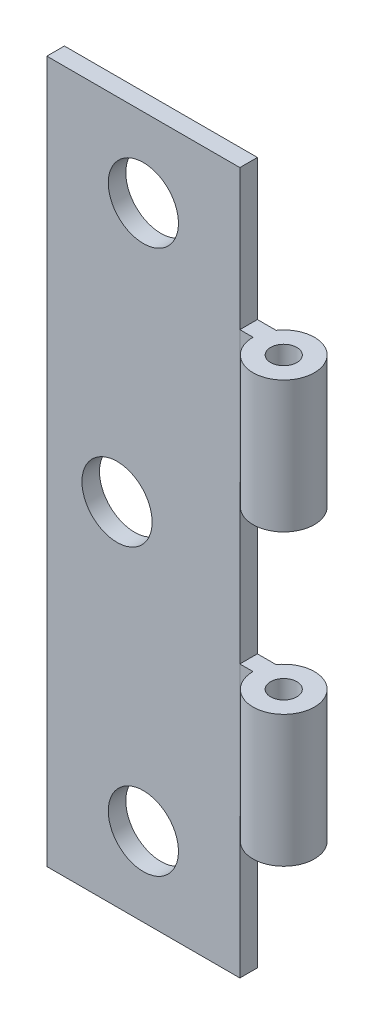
ISO-10303-21;
HEADER;
FILE_DESCRIPTION(('STEP AP214'),'2;1');
FILE_NAME('part.step','',(''),(''),'','','');
FILE_SCHEMA(('AUTOMOTIVE_DESIGN { 1 0 10303 214 1 1 1 1 }'));
ENDSEC;
DATA;
#1=APPLICATION_CONTEXT('core data for automotive mechanical design processes');
#2=APPLICATION_PROTOCOL_DEFINITION('international standard','automotive_design',2000,#1);
#3=PRODUCT_CONTEXT('',#1,'mechanical');
#4=PRODUCT('Part','Part','',(#3));
#5=PRODUCT_RELATED_PRODUCT_CATEGORY('part','',(#4));
#6=PRODUCT_DEFINITION_FORMATION('','',#4);
#7=PRODUCT_DEFINITION_CONTEXT('part definition',#1,'design');
#8=PRODUCT_DEFINITION('design','',#6,#7);
#9=PRODUCT_DEFINITION_SHAPE('','',#8);
#10=(LENGTH_UNIT() NAMED_UNIT(*) SI_UNIT(.MILLI.,.METRE.));
#11=(NAMED_UNIT(*) PLANE_ANGLE_UNIT() SI_UNIT($,.RADIAN.));
#12=(NAMED_UNIT(*) SI_UNIT($,.STERADIAN.) SOLID_ANGLE_UNIT());
#13=UNCERTAINTY_MEASURE_WITH_UNIT(LENGTH_MEASURE(1.E-05),#10,'distance_accuracy_value','');
#14=(GEOMETRIC_REPRESENTATION_CONTEXT(3) GLOBAL_UNCERTAINTY_ASSIGNED_CONTEXT((#13)) GLOBAL_UNIT_ASSIGNED_CONTEXT((#10,
#11,#12)) REPRESENTATION_CONTEXT('',''));
#15=CARTESIAN_POINT('',(0.,0.,0.));
#16=DIRECTION('',(0.,0.,1.));
#17=DIRECTION('',(1.,0.,0.));
#18=AXIS2_PLACEMENT_3D('',#15,#16,#17);
#19=CARTESIAN_POINT('',(12.7,-39.6077241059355,0.));
#20=DIRECTION('',(0.,1.,0.));
#21=DIRECTION('',(0.,0.,1.));
#22=AXIS2_PLACEMENT_3D('',#19,#20,#21);
#23=CYLINDRICAL_SURFACE('',#22,1.190625);
#24=CARTESIAN_POINT('',(12.7,-19.05,0.));
#25=DIRECTION('',(0.,1.,0.));
#26=DIRECTION('',(0.,0.,1.));
#27=AXIS2_PLACEMENT_3D('',#24,#25,#26);
#28=CIRCLE('',#27,1.190625);
#29=CARTESIAN_POINT('',(12.7,-19.05,1.190625));
#30=VERTEX_POINT('',#29);
#31=EDGE_CURVE('E140',#30,#30,#28,.F.);
#32=ORIENTED_EDGE('',*,*,#31,.T.);
#33=EDGE_LOOP('',(#32));
#34=FACE_BOUND('',#33,.T.);
#35=CARTESIAN_POINT('',(12.7,-7.14375,0.));
#36=DIRECTION('',(0.,1.,0.));
#37=DIRECTION('',(0.,0.,1.));
#38=AXIS2_PLACEMENT_3D('',#35,#36,#37);
#39=CIRCLE('',#38,1.190625);
#40=CARTESIAN_POINT('',(12.7,-7.14375,1.190625));
#41=VERTEX_POINT('',#40);
#42=EDGE_CURVE('E13',#41,#41,#39,.F.);
#43=ORIENTED_EDGE('',*,*,#42,.F.);
#44=EDGE_LOOP('',(#43));
#45=FACE_BOUND('',#44,.T.);
#46=ADVANCED_FACE('F67',(#34,#45),#23,.F.);
#47=CARTESIAN_POINT('',(12.7,-39.6077241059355,0.));
#48=DIRECTION('',(0.,1.,0.));
#49=DIRECTION('',(0.,0.,1.));
#50=AXIS2_PLACEMENT_3D('',#47,#48,#49);
#51=CYLINDRICAL_SURFACE('',#50,2.778125);
#52=CARTESIAN_POINT('',(12.7,-7.14375,0.));
#53=DIRECTION('',(0.,1.,0.));
#54=DIRECTION('',(0.,0.,1.));
#55=AXIS2_PLACEMENT_3D('',#52,#53,#54);
#56=CIRCLE('',#55,2.778125);
#57=CARTESIAN_POINT('',(10.4201266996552,-7.14375,-1.5875));
#58=VERTEX_POINT('',#57);
#59=CARTESIAN_POINT('',(9.92187500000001,-7.14375,0.));
#60=VERTEX_POINT('',#59);
#61=EDGE_CURVE('E84',#58,#60,#56,.F.);
#62=ORIENTED_EDGE('',*,*,#61,.T.);
#63=DIRECTION('',(0.,1.,0.));
#64=VECTOR('',#63,1.);
#65=CARTESIAN_POINT('',(9.92187500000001,-39.6077241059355,0.));
#66=LINE('',#65,#64);
#67=CARTESIAN_POINT('',(9.92187500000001,-19.05,0.));
#68=VERTEX_POINT('',#67);
#69=EDGE_CURVE('E136',#68,#60,#66,.T.);
#70=ORIENTED_EDGE('',*,*,#69,.F.);
#71=CARTESIAN_POINT('',(12.7,-19.05,0.));
#72=DIRECTION('',(0.,1.,0.));
#73=DIRECTION('',(0.,0.,1.));
#74=AXIS2_PLACEMENT_3D('',#71,#72,#73);
#75=CIRCLE('',#74,2.778125);
#76=CARTESIAN_POINT('',(10.4201266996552,-19.05,-1.5875));
#77=VERTEX_POINT('',#76);
#78=EDGE_CURVE('E103',#77,#68,#75,.F.);
#79=ORIENTED_EDGE('',*,*,#78,.F.);
#80=DIRECTION('',(0.,1.,0.));
#81=VECTOR('',#80,1.);
#82=CARTESIAN_POINT('',(10.4201266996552,-39.6077241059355,-1.5875));
#83=LINE('',#82,#81);
#84=EDGE_CURVE('E134',#77,#58,#83,.T.);
#85=ORIENTED_EDGE('',*,*,#84,.T.);
#86=EDGE_LOOP('',(#62,#70,#79,#85));
#87=FACE_BOUND('',#86,.T.);
#88=ADVANCED_FACE('F159',(#87),#51,.T.);
#89=CARTESIAN_POINT('',(8.73125000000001,-39.6077241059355,0.));
#90=DIRECTION('',(0.,0.,1.));
#91=DIRECTION('',(1.,0.,0.));
#92=AXIS2_PLACEMENT_3D('',#89,#90,#91);
#93=PLANE('',#92);
#94=ORIENTED_EDGE('',*,*,#69,.T.);
#95=DIRECTION('',(-1.,0.,0.));
#96=VECTOR('',#95,1.);
#97=CARTESIAN_POINT('',(8.73125000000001,-7.14375,0.));
#98=LINE('',#97,#96);
#99=CARTESIAN_POINT('',(8.73125000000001,-7.14375,0.));
#100=VERTEX_POINT('',#99);
#101=EDGE_CURVE('E130',#60,#100,#98,.T.);
#102=ORIENTED_EDGE('',*,*,#101,.T.);
#103=DIRECTION('',(0.,1.,0.));
#104=VECTOR('',#103,1.);
#105=CARTESIAN_POINT('',(8.73125000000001,-39.6077241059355,0.));
#106=LINE('',#105,#104);
#107=CARTESIAN_POINT('',(8.73125000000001,-19.05,0.));
#108=VERTEX_POINT('',#107);
#109=EDGE_CURVE('E125',#108,#100,#106,.T.);
#110=ORIENTED_EDGE('',*,*,#109,.F.);
#111=DIRECTION('',(-1.,0.,0.));
#112=VECTOR('',#111,1.);
#113=CARTESIAN_POINT('',(8.73125000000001,-19.05,0.));
#114=LINE('',#113,#112);
#115=EDGE_CURVE('E109',#68,#108,#114,.T.);
#116=ORIENTED_EDGE('',*,*,#115,.F.);
#117=EDGE_LOOP('',(#94,#102,#110,#116));
#118=FACE_BOUND('',#117,.T.);
#119=ADVANCED_FACE('F129',(#118),#93,.T.);
#120=CARTESIAN_POINT('',(8.73125000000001,-39.6077241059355,-1.5875));
#121=DIRECTION('',(0.,0.,1.));
#122=DIRECTION('',(1.,0.,0.));
#123=AXIS2_PLACEMENT_3D('',#120,#121,#122);
#124=PLANE('',#123);
#125=DIRECTION('',(-1.,0.,0.));
#126=VECTOR('',#125,1.);
#127=CARTESIAN_POINT('',(8.73125000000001,-7.14375,-1.5875));
#128=LINE('',#127,#126);
#129=CARTESIAN_POINT('',(8.73125000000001,-7.14375,-1.5875));
#130=VERTEX_POINT('',#129);
#131=EDGE_CURVE('E76',#58,#130,#128,.T.);
#132=ORIENTED_EDGE('',*,*,#131,.F.);
#133=ORIENTED_EDGE('',*,*,#84,.F.);
#134=DIRECTION('',(-1.,0.,0.));
#135=VECTOR('',#134,1.);
#136=CARTESIAN_POINT('',(8.73125000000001,-19.05,-1.5875));
#137=LINE('',#136,#135);
#138=CARTESIAN_POINT('',(8.73125000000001,-19.05,-1.5875));
#139=VERTEX_POINT('',#138);
#140=EDGE_CURVE('E132',#77,#139,#137,.T.);
#141=ORIENTED_EDGE('',*,*,#140,.T.);
#142=DIRECTION('',(0.,1.,0.));
#143=VECTOR('',#142,1.);
#144=CARTESIAN_POINT('',(8.73125000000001,-39.6077241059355,-1.5875));
#145=LINE('',#144,#143);
#146=EDGE_CURVE('E70',#139,#130,#145,.T.);
#147=ORIENTED_EDGE('',*,*,#146,.T.);
#148=EDGE_LOOP('',(#132,#133,#141,#147));
#149=FACE_BOUND('',#148,.T.);
#150=ADVANCED_FACE('F156',(#149),#124,.F.);
#151=CARTESIAN_POINT('',(8.73125000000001,-39.6077241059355,-1.5875));
#152=DIRECTION('',(-1.,0.,0.));
#153=DIRECTION('',(0.,0.,1.));
#154=AXIS2_PLACEMENT_3D('',#151,#152,#153);
#155=PLANE('',#154);
#156=ORIENTED_EDGE('',*,*,#109,.T.);
#157=DIRECTION('',(0.,0.,-1.));
#158=VECTOR('',#157,1.);
#159=CARTESIAN_POINT('',(8.73125000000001,-7.14375,-1.5875));
#160=LINE('',#159,#158);
#161=EDGE_CURVE('E118',#100,#130,#160,.T.);
#162=ORIENTED_EDGE('',*,*,#161,.T.);
#163=ORIENTED_EDGE('',*,*,#146,.F.);
#164=DIRECTION('',(0.,0.,-1.));
#165=VECTOR('',#164,1.);
#166=CARTESIAN_POINT('',(8.73125000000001,-19.05,-1.5875));
#167=LINE('',#166,#165);
#168=EDGE_CURVE('E113',#108,#139,#167,.T.);
#169=ORIENTED_EDGE('',*,*,#168,.F.);
#170=EDGE_LOOP('',(#156,#162,#163,#169));
#171=FACE_BOUND('',#170,.T.);
#172=ADVANCED_FACE('F123',(#171),#155,.T.);
#173=CARTESIAN_POINT('',(0.,-19.05,2.778125));
#174=DIRECTION('',(0.,1.,0.));
#175=DIRECTION('',(0.,0.,1.));
#176=AXIS2_PLACEMENT_3D('',#173,#174,#175);
#177=PLANE('',#176);
#178=ORIENTED_EDGE('',*,*,#115,.T.);
#179=ORIENTED_EDGE('',*,*,#168,.T.);
#180=ORIENTED_EDGE('',*,*,#140,.F.);
#181=ORIENTED_EDGE('',*,*,#78,.T.);
#182=EDGE_LOOP('',(#178,#179,#180,#181));
#183=FACE_BOUND('',#182,.T.);
#184=ORIENTED_EDGE('',*,*,#31,.F.);
#185=EDGE_LOOP('',(#184));
#186=FACE_BOUND('',#185,.T.);
#187=ADVANCED_FACE('F111',(#183,#186),#177,.F.);
#188=CARTESIAN_POINT('',(0.,-7.14375,2.778125));
#189=DIRECTION('',(0.,1.,0.));
#190=DIRECTION('',(0.,0.,1.));
#191=AXIS2_PLACEMENT_3D('',#188,#189,#190);
#192=PLANE('',#191);
#193=ORIENTED_EDGE('',*,*,#101,.F.);
#194=ORIENTED_EDGE('',*,*,#61,.F.);
#195=ORIENTED_EDGE('',*,*,#131,.T.);
#196=ORIENTED_EDGE('',*,*,#161,.F.);
#197=EDGE_LOOP('',(#193,#194,#195,#196));
#198=FACE_BOUND('',#197,.T.);
#199=ORIENTED_EDGE('',*,*,#42,.T.);
#200=EDGE_LOOP('',(#199));
#201=FACE_BOUND('',#200,.T.);
#202=ADVANCED_FACE('F149',(#198,#201),#192,.T.);
#203=CLOSED_SHELL('',(#46,#88,#119,#150,#172,#187,#202));
#204=MANIFOLD_SOLID_BREP('B2',#203);
#205=CARTESIAN_POINT('',(8.73125000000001,-39.6077241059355,-1.5875));
#206=DIRECTION('',(-1.,0.,0.));
#207=DIRECTION('',(0.,0.,1.));
#208=AXIS2_PLACEMENT_3D('',#205,#206,#207);
#209=PLANE('',#208);
#210=DIRECTION('',(0.,0.,-1.));
#211=VECTOR('',#210,1.);
#212=CARTESIAN_POINT('',(8.73125000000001,7.14375,-1.5875));
#213=LINE('',#212,#211);
#214=CARTESIAN_POINT('',(8.73125000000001,7.14375,0.));
#215=VERTEX_POINT('',#214);
#216=CARTESIAN_POINT('',(8.73125000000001,7.14375,-1.5875));
#217=VERTEX_POINT('',#216);
#218=EDGE_CURVE('E65',#215,#217,#213,.T.);
#219=ORIENTED_EDGE('',*,*,#218,.F.);
#220=DIRECTION('',(0.,1.,0.));
#221=VECTOR('',#220,1.);
#222=CARTESIAN_POINT('',(8.73125000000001,-39.6077241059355,0.));
#223=LINE('',#222,#221);
#224=CARTESIAN_POINT('',(8.73125000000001,19.05,0.));
#225=VERTEX_POINT('',#224);
#226=EDGE_CURVE('E271',#215,#225,#223,.T.);
#227=ORIENTED_EDGE('',*,*,#226,.T.);
#228=DIRECTION('',(0.,0.,-1.));
#229=VECTOR('',#228,1.);
#230=CARTESIAN_POINT('',(8.73125000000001,19.05,-1.5875));
#231=LINE('',#230,#229);
#232=CARTESIAN_POINT('',(8.73125000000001,19.05,-1.5875));
#233=VERTEX_POINT('',#232);
#234=EDGE_CURVE('E229',#225,#233,#231,.T.);
#235=ORIENTED_EDGE('',*,*,#234,.T.);
#236=DIRECTION('',(0.,1.,0.));
#237=VECTOR('',#236,1.);
#238=CARTESIAN_POINT('',(8.73125000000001,-39.6077241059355,-1.5875));
#239=LINE('',#238,#237);
#240=EDGE_CURVE('E277',#217,#233,#239,.T.);
#241=ORIENTED_EDGE('',*,*,#240,.F.);
#242=EDGE_LOOP('',(#219,#227,#235,#241));
#243=FACE_BOUND('',#242,.T.);
#244=ADVANCED_FACE('F221',(#243),#209,.T.);
#245=CARTESIAN_POINT('',(8.73125000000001,-39.6077241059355,-1.5875));
#246=DIRECTION('',(0.,0.,1.));
#247=DIRECTION('',(1.,0.,0.));
#248=AXIS2_PLACEMENT_3D('',#245,#246,#247);
#249=PLANE('',#248);
#250=DIRECTION('',(0.,1.,0.));
#251=VECTOR('',#250,1.);
#252=CARTESIAN_POINT('',(10.4201266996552,-39.6077241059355,-1.5875));
#253=LINE('',#252,#251);
#254=CARTESIAN_POINT('',(10.4201266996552,7.14375,-1.5875));
#255=VERTEX_POINT('',#254);
#256=CARTESIAN_POINT('',(10.4201266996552,19.05,-1.5875));
#257=VERTEX_POINT('',#256);
#258=EDGE_CURVE('E276',#255,#257,#253,.T.);
#259=ORIENTED_EDGE('',*,*,#258,.F.);
#260=DIRECTION('',(-1.,0.,0.));
#261=VECTOR('',#260,1.);
#262=CARTESIAN_POINT('',(8.73125000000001,7.14375,-1.5875));
#263=LINE('',#262,#261);
#264=EDGE_CURVE('E290',#255,#217,#263,.T.);
#265=ORIENTED_EDGE('',*,*,#264,.T.);
#266=ORIENTED_EDGE('',*,*,#240,.T.);
#267=DIRECTION('',(-1.,0.,0.));
#268=VECTOR('',#267,1.);
#269=CARTESIAN_POINT('',(8.73125000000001,19.05,-1.5875));
#270=LINE('',#269,#268);
#271=EDGE_CURVE('E236',#257,#233,#270,.T.);
#272=ORIENTED_EDGE('',*,*,#271,.F.);
#273=EDGE_LOOP('',(#259,#265,#266,#272));
#274=FACE_BOUND('',#273,.T.);
#275=ADVANCED_FACE('F300',(#274),#249,.F.);
#276=CARTESIAN_POINT('',(8.73125000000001,-39.6077241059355,0.));
#277=DIRECTION('',(0.,0.,1.));
#278=DIRECTION('',(1.,0.,0.));
#279=AXIS2_PLACEMENT_3D('',#276,#277,#278);
#280=PLANE('',#279);
#281=DIRECTION('',(-1.,0.,0.));
#282=VECTOR('',#281,1.);
#283=CARTESIAN_POINT('',(8.73125000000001,7.14375,0.));
#284=LINE('',#283,#282);
#285=CARTESIAN_POINT('',(9.92187500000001,7.14375,0.));
#286=VERTEX_POINT('',#285);
#287=EDGE_CURVE('E243',#286,#215,#284,.T.);
#288=ORIENTED_EDGE('',*,*,#287,.F.);
#289=DIRECTION('',(0.,1.,0.));
#290=VECTOR('',#289,1.);
#291=CARTESIAN_POINT('',(9.92187500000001,-39.6077241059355,0.));
#292=LINE('',#291,#290);
#293=CARTESIAN_POINT('',(9.92187500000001,19.05,0.));
#294=VERTEX_POINT('',#293);
#295=EDGE_CURVE('E267',#286,#294,#292,.T.);
#296=ORIENTED_EDGE('',*,*,#295,.T.);
#297=DIRECTION('',(-1.,0.,0.));
#298=VECTOR('',#297,1.);
#299=CARTESIAN_POINT('',(8.73125000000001,19.05,0.));
#300=LINE('',#299,#298);
#301=EDGE_CURVE('E261',#294,#225,#300,.T.);
#302=ORIENTED_EDGE('',*,*,#301,.T.);
#303=ORIENTED_EDGE('',*,*,#226,.F.);
#304=EDGE_LOOP('',(#288,#296,#302,#303));
#305=FACE_BOUND('',#304,.T.);
#306=ADVANCED_FACE('F223',(#305),#280,.T.);
#307=CARTESIAN_POINT('',(12.7,-39.6077241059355,0.));
#308=DIRECTION('',(0.,1.,0.));
#309=DIRECTION('',(0.,0.,1.));
#310=AXIS2_PLACEMENT_3D('',#307,#308,#309);
#311=CYLINDRICAL_SURFACE('',#310,2.778125);
#312=CARTESIAN_POINT('',(12.7,7.14375,0.));
#313=DIRECTION('',(0.,1.,0.));
#314=DIRECTION('',(-1.,0.,0.));
#315=AXIS2_PLACEMENT_3D('',#312,#313,#314);
#316=CIRCLE('',#315,2.778125);
#317=EDGE_CURVE('E288',#255,#286,#316,.F.);
#318=ORIENTED_EDGE('',*,*,#317,.F.);
#319=ORIENTED_EDGE('',*,*,#258,.T.);
#320=CARTESIAN_POINT('',(12.7,19.05,0.));
#321=DIRECTION('',(0.,1.,0.));
#322=DIRECTION('',(0.,0.,1.));
#323=AXIS2_PLACEMENT_3D('',#320,#321,#322);
#324=CIRCLE('',#323,2.778125);
#325=EDGE_CURVE('E274',#257,#294,#324,.F.);
#326=ORIENTED_EDGE('',*,*,#325,.T.);
#327=ORIENTED_EDGE('',*,*,#295,.F.);
#328=EDGE_LOOP('',(#318,#319,#326,#327));
#329=FACE_BOUND('',#328,.T.);
#330=ADVANCED_FACE('F297',(#329),#311,.T.);
#331=CARTESIAN_POINT('',(0.,19.05,2.778125));
#332=DIRECTION('',(0.,1.,0.));
#333=DIRECTION('',(0.,0.,1.));
#334=AXIS2_PLACEMENT_3D('',#331,#332,#333);
#335=PLANE('',#334);
#336=ORIENTED_EDGE('',*,*,#325,.F.);
#337=ORIENTED_EDGE('',*,*,#271,.T.);
#338=ORIENTED_EDGE('',*,*,#234,.F.);
#339=ORIENTED_EDGE('',*,*,#301,.F.);
#340=EDGE_LOOP('',(#336,#337,#338,#339));
#341=FACE_BOUND('',#340,.T.);
#342=CARTESIAN_POINT('',(12.7,19.05,0.));
#343=DIRECTION('',(0.,1.,0.));
#344=DIRECTION('',(0.,0.,1.));
#345=AXIS2_PLACEMENT_3D('',#342,#343,#344);
#346=CIRCLE('',#345,1.190625);
#347=CARTESIAN_POINT('',(12.7,19.05,1.190625));
#348=VERTEX_POINT('',#347);
#349=EDGE_CURVE('E273',#348,#348,#346,.F.);
#350=ORIENTED_EDGE('',*,*,#349,.T.);
#351=EDGE_LOOP('',(#350));
#352=FACE_BOUND('',#351,.T.);
#353=ADVANCED_FACE('F259',(#341,#352),#335,.T.);
#354=CARTESIAN_POINT('',(0.,7.14375,2.778125));
#355=DIRECTION('',(0.,1.,0.));
#356=DIRECTION('',(-1.,0.,0.));
#357=AXIS2_PLACEMENT_3D('',#354,#355,#356);
#358=PLANE('',#357);
#359=ORIENTED_EDGE('',*,*,#287,.T.);
#360=ORIENTED_EDGE('',*,*,#218,.T.);
#361=ORIENTED_EDGE('',*,*,#264,.F.);
#362=ORIENTED_EDGE('',*,*,#317,.T.);
#363=EDGE_LOOP('',(#359,#360,#361,#362));
#364=FACE_BOUND('',#363,.T.);
#365=CARTESIAN_POINT('',(12.7,7.14375,0.));
#366=DIRECTION('',(0.,1.,0.));
#367=DIRECTION('',(-1.,0.,0.));
#368=AXIS2_PLACEMENT_3D('',#365,#366,#367);
#369=CIRCLE('',#368,1.190625);
#370=CARTESIAN_POINT('',(11.509375,7.14375,0.));
#371=VERTEX_POINT('',#370);
#372=EDGE_CURVE('E281',#371,#371,#369,.F.);
#373=ORIENTED_EDGE('',*,*,#372,.F.);
#374=EDGE_LOOP('',(#373));
#375=FACE_BOUND('',#374,.T.);
#376=ADVANCED_FACE('F302',(#364,#375),#358,.F.);
#377=CARTESIAN_POINT('',(12.7,-39.6077241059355,0.));
#378=DIRECTION('',(0.,1.,0.));
#379=DIRECTION('',(0.,0.,1.));
#380=AXIS2_PLACEMENT_3D('',#377,#378,#379);
#381=CYLINDRICAL_SURFACE('',#380,1.190625);
#382=ORIENTED_EDGE('',*,*,#372,.T.);
#383=EDGE_LOOP('',(#382));
#384=FACE_BOUND('',#383,.T.);
#385=ORIENTED_EDGE('',*,*,#349,.F.);
#386=EDGE_LOOP('',(#385));
#387=FACE_BOUND('',#386,.T.);
#388=ADVANCED_FACE('F305',(#384,#387),#381,.F.);
#389=CLOSED_SHELL('',(#244,#275,#306,#330,#353,#376,#388));
#390=MANIFOLD_SOLID_BREP('B7',#389);
#391=CARTESIAN_POINT('',(8.73125000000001,-31.75,-1.5875));
#392=DIRECTION('',(1.,0.,0.));
#393=DIRECTION('',(0.,0.,-1.));
#394=AXIS2_PLACEMENT_3D('',#391,#392,#393);
#395=PLANE('',#394);
#396=DIRECTION('',(0.,1.,0.));
#397=VECTOR('',#396,1.);
#398=CARTESIAN_POINT('',(8.73125000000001,-31.75,0.));
#399=LINE('',#398,#397);
#400=CARTESIAN_POINT('',(8.73125000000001,-31.75,0.));
#401=VERTEX_POINT('',#400);
#402=CARTESIAN_POINT('',(8.73125000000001,31.75,0.));
#403=VERTEX_POINT('',#402);
#404=EDGE_CURVE('E433',#401,#403,#399,.T.);
#405=ORIENTED_EDGE('',*,*,#404,.F.);
#406=DIRECTION('',(0.,0.,1.));
#407=VECTOR('',#406,1.);
#408=CARTESIAN_POINT('',(8.73125000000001,-31.75,-1.5875));
#409=LINE('',#408,#407);
#410=CARTESIAN_POINT('',(8.73125000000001,-31.75,-1.5875));
#411=VERTEX_POINT('',#410);
#412=EDGE_CURVE('E219',#411,#401,#409,.T.);
#413=ORIENTED_EDGE('',*,*,#412,.F.);
#414=DIRECTION('',(0.,1.,0.));
#415=VECTOR('',#414,1.);
#416=CARTESIAN_POINT('',(8.73125000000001,-31.75,-1.5875));
#417=LINE('',#416,#415);
#418=CARTESIAN_POINT('',(8.73125000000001,31.75,-1.5875));
#419=VERTEX_POINT('',#418);
#420=EDGE_CURVE('E426',#411,#419,#417,.T.);
#421=ORIENTED_EDGE('',*,*,#420,.T.);
#422=DIRECTION('',(0.,0.,1.));
#423=VECTOR('',#422,1.);
#424=CARTESIAN_POINT('',(8.73125000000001,31.75,-1.5875));
#425=LINE('',#424,#423);
#426=EDGE_CURVE('E409',#419,#403,#425,.T.);
#427=ORIENTED_EDGE('',*,*,#426,.T.);
#428=EDGE_LOOP('',(#405,#413,#421,#427));
#429=FACE_BOUND('',#428,.T.);
#430=ADVANCED_FACE('F366',(#429),#395,.T.);
#431=CARTESIAN_POINT('',(-8.73124999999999,-31.75,-1.5875));
#432=DIRECTION('',(0.,-1.,0.));
#433=DIRECTION('',(0.,0.,-1.));
#434=AXIS2_PLACEMENT_3D('',#431,#432,#433);
#435=PLANE('',#434);
#436=DIRECTION('',(1.,0.,0.));
#437=VECTOR('',#436,1.);
#438=CARTESIAN_POINT('',(-8.73124999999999,-31.75,0.));
#439=LINE('',#438,#437);
#440=CARTESIAN_POINT('',(-8.73124999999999,-31.75,0.));
#441=VERTEX_POINT('',#440);
#442=EDGE_CURVE('E428',#441,#401,#439,.T.);
#443=ORIENTED_EDGE('',*,*,#442,.F.);
#444=DIRECTION('',(0.,0.,1.));
#445=VECTOR('',#444,1.);
#446=CARTESIAN_POINT('',(-8.73124999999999,-31.75,-1.5875));
#447=LINE('',#446,#445);
#448=CARTESIAN_POINT('',(-8.73124999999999,-31.75,-1.5875));
#449=VERTEX_POINT('',#448);
#450=EDGE_CURVE('E375',#449,#441,#447,.T.);
#451=ORIENTED_EDGE('',*,*,#450,.F.);
#452=DIRECTION('',(1.,0.,0.));
#453=VECTOR('',#452,1.);
#454=CARTESIAN_POINT('',(-8.73124999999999,-31.75,-1.5875));
#455=LINE('',#454,#453);
#456=EDGE_CURVE('E423',#449,#411,#455,.T.);
#457=ORIENTED_EDGE('',*,*,#456,.T.);
#458=ORIENTED_EDGE('',*,*,#412,.T.);
#459=EDGE_LOOP('',(#443,#451,#457,#458));
#460=FACE_BOUND('',#459,.T.);
#461=ADVANCED_FACE('F478',(#460),#435,.T.);
#462=CARTESIAN_POINT('',(-8.73124999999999,-31.75,-1.5875));
#463=DIRECTION('',(-1.,0.,0.));
#464=DIRECTION('',(0.,0.,1.));
#465=AXIS2_PLACEMENT_3D('',#462,#463,#464);
#466=PLANE('',#465);
#467=DIRECTION('',(0.,-1.,0.));
#468=VECTOR('',#467,1.);
#469=CARTESIAN_POINT('',(-8.73124999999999,-31.75,0.));
#470=LINE('',#469,#468);
#471=CARTESIAN_POINT('',(-8.73124999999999,31.75,0.));
#472=VERTEX_POINT('',#471);
#473=EDGE_CURVE('E417',#472,#441,#470,.T.);
#474=ORIENTED_EDGE('',*,*,#473,.F.);
#475=DIRECTION('',(0.,0.,1.));
#476=VECTOR('',#475,1.);
#477=CARTESIAN_POINT('',(-8.73124999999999,31.75,-1.5875));
#478=LINE('',#477,#476);
#479=CARTESIAN_POINT('',(-8.73124999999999,31.75,-1.5875));
#480=VERTEX_POINT('',#479);
#481=EDGE_CURVE('E412',#480,#472,#478,.T.);
#482=ORIENTED_EDGE('',*,*,#481,.F.);
#483=DIRECTION('',(0.,-1.,0.));
#484=VECTOR('',#483,1.);
#485=CARTESIAN_POINT('',(-8.73124999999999,-31.75,-1.5875));
#486=LINE('',#485,#484);
#487=EDGE_CURVE('E415',#480,#449,#486,.T.);
#488=ORIENTED_EDGE('',*,*,#487,.T.);
#489=ORIENTED_EDGE('',*,*,#450,.T.);
#490=EDGE_LOOP('',(#474,#482,#488,#489));
#491=FACE_BOUND('',#490,.T.);
#492=ADVANCED_FACE('F414',(#491),#466,.T.);
#493=CARTESIAN_POINT('',(-8.73124999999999,31.75,-1.5875));
#494=DIRECTION('',(0.,1.,0.));
#495=DIRECTION('',(0.,0.,1.));
#496=AXIS2_PLACEMENT_3D('',#493,#494,#495);
#497=PLANE('',#496);
#498=DIRECTION('',(-1.,0.,0.));
#499=VECTOR('',#498,1.);
#500=CARTESIAN_POINT('',(-8.73124999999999,31.75,0.));
#501=LINE('',#500,#499);
#502=EDGE_CURVE('E436',#403,#472,#501,.T.);
#503=ORIENTED_EDGE('',*,*,#502,.F.);
#504=ORIENTED_EDGE('',*,*,#426,.F.);
#505=DIRECTION('',(-1.,0.,0.));
#506=VECTOR('',#505,1.);
#507=CARTESIAN_POINT('',(-8.73124999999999,31.75,-1.5875));
#508=LINE('',#507,#506);
#509=EDGE_CURVE('E422',#419,#480,#508,.T.);
#510=ORIENTED_EDGE('',*,*,#509,.T.);
#511=ORIENTED_EDGE('',*,*,#481,.T.);
#512=EDGE_LOOP('',(#503,#504,#510,#511));
#513=FACE_BOUND('',#512,.T.);
#514=ADVANCED_FACE('F425',(#513),#497,.T.);
#515=CARTESIAN_POINT('',(0.,0.,-1.5875));
#516=DIRECTION('',(0.,0.,-1.));
#517=DIRECTION('',(-1.,0.,0.));
#518=AXIS2_PLACEMENT_3D('',#515,#516,#517);
#519=PLANE('',#518);
#520=CARTESIAN_POINT('',(-2.38125,0.,-1.5875));
#521=DIRECTION('',(0.,0.,-1.));
#522=DIRECTION('',(-1.,0.,0.));
#523=AXIS2_PLACEMENT_3D('',#520,#521,#522);
#524=CIRCLE('',#523,3.175);
#525=CARTESIAN_POINT('',(-5.55625,0.,-1.5875));
#526=VERTEX_POINT('',#525);
#527=EDGE_CURVE('E448',#526,#526,#524,.T.);
#528=ORIENTED_EDGE('',*,*,#527,.F.);
#529=EDGE_LOOP('',(#528));
#530=FACE_BOUND('',#529,.T.);
#531=CARTESIAN_POINT('',(0.,-24.60625,-1.5875));
#532=DIRECTION('',(0.,0.,-1.));
#533=DIRECTION('',(-1.,0.,0.));
#534=AXIS2_PLACEMENT_3D('',#531,#532,#533);
#535=CIRCLE('',#534,3.175);
#536=CARTESIAN_POINT('',(-3.17499999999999,-24.60625,-1.5875));
#537=VERTEX_POINT('',#536);
#538=EDGE_CURVE('E453',#537,#537,#535,.T.);
#539=ORIENTED_EDGE('',*,*,#538,.F.);
#540=EDGE_LOOP('',(#539));
#541=FACE_BOUND('',#540,.T.);
#542=CARTESIAN_POINT('',(0.,24.60625,-1.5875));
#543=DIRECTION('',(0.,0.,-1.));
#544=DIRECTION('',(-1.,0.,0.));
#545=AXIS2_PLACEMENT_3D('',#542,#543,#544);
#546=CIRCLE('',#545,3.175);
#547=CARTESIAN_POINT('',(-3.17499999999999,24.60625,-1.5875));
#548=VERTEX_POINT('',#547);
#549=EDGE_CURVE('E445',#548,#548,#546,.T.);
#550=ORIENTED_EDGE('',*,*,#549,.F.);
#551=EDGE_LOOP('',(#550));
#552=FACE_BOUND('',#551,.T.);
#553=ORIENTED_EDGE('',*,*,#420,.F.);
#554=ORIENTED_EDGE('',*,*,#456,.F.);
#555=ORIENTED_EDGE('',*,*,#487,.F.);
#556=ORIENTED_EDGE('',*,*,#509,.F.);
#557=EDGE_LOOP('',(#553,#554,#555,#556));
#558=FACE_BOUND('',#557,.T.);
#559=ADVANCED_FACE('F421',(#530,#541,#552,#558),#519,.T.);
#560=CARTESIAN_POINT('',(0.,0.,0.));
#561=DIRECTION('',(0.,0.,-1.));
#562=DIRECTION('',(-1.,0.,0.));
#563=AXIS2_PLACEMENT_3D('',#560,#561,#562);
#564=PLANE('',#563);
#565=CARTESIAN_POINT('',(-2.38125,0.,0.));
#566=DIRECTION('',(0.,0.,-1.));
#567=DIRECTION('',(-1.,0.,0.));
#568=AXIS2_PLACEMENT_3D('',#565,#566,#567);
#569=CIRCLE('',#568,3.175);
#570=CARTESIAN_POINT('',(-5.55625,0.,0.));
#571=VERTEX_POINT('',#570);
#572=EDGE_CURVE('E369',#571,#571,#569,.T.);
#573=ORIENTED_EDGE('',*,*,#572,.T.);
#574=EDGE_LOOP('',(#573));
#575=FACE_BOUND('',#574,.T.);
#576=CARTESIAN_POINT('',(0.,-24.60625,0.));
#577=DIRECTION('',(0.,0.,-1.));
#578=DIRECTION('',(-1.,0.,0.));
#579=AXIS2_PLACEMENT_3D('',#576,#577,#578);
#580=CIRCLE('',#579,3.175);
#581=CARTESIAN_POINT('',(-3.17499999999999,-24.60625,0.));
#582=VERTEX_POINT('',#581);
#583=EDGE_CURVE('E446',#582,#582,#580,.T.);
#584=ORIENTED_EDGE('',*,*,#583,.T.);
#585=EDGE_LOOP('',(#584));
#586=FACE_BOUND('',#585,.T.);
#587=CARTESIAN_POINT('',(0.,24.60625,0.));
#588=DIRECTION('',(0.,0.,-1.));
#589=DIRECTION('',(-1.,0.,0.));
#590=AXIS2_PLACEMENT_3D('',#587,#588,#589);
#591=CIRCLE('',#590,3.175);
#592=CARTESIAN_POINT('',(-3.17499999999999,24.60625,0.));
#593=VERTEX_POINT('',#592);
#594=EDGE_CURVE('E437',#593,#593,#591,.T.);
#595=ORIENTED_EDGE('',*,*,#594,.T.);
#596=EDGE_LOOP('',(#595));
#597=FACE_BOUND('',#596,.T.);
#598=ORIENTED_EDGE('',*,*,#404,.T.);
#599=ORIENTED_EDGE('',*,*,#502,.T.);
#600=ORIENTED_EDGE('',*,*,#473,.T.);
#601=ORIENTED_EDGE('',*,*,#442,.T.);
#602=EDGE_LOOP('',(#598,#599,#600,#601));
#603=FACE_BOUND('',#602,.T.);
#604=ADVANCED_FACE('F466',(#575,#586,#597,#603),#564,.F.);
#605=CARTESIAN_POINT('',(0.,24.60625,2.778125));
#606=DIRECTION('',(0.,0.,-1.));
#607=DIRECTION('',(-1.,0.,0.));
#608=AXIS2_PLACEMENT_3D('',#605,#606,#607);
#609=CYLINDRICAL_SURFACE('',#608,3.175);
#610=ORIENTED_EDGE('',*,*,#549,.T.);
#611=EDGE_LOOP('',(#610));
#612=FACE_BOUND('',#611,.T.);
#613=ORIENTED_EDGE('',*,*,#594,.F.);
#614=EDGE_LOOP('',(#613));
#615=FACE_BOUND('',#614,.T.);
#616=ADVANCED_FACE('F462',(#612,#615),#609,.F.);
#617=CARTESIAN_POINT('',(0.,-24.60625,2.778125));
#618=DIRECTION('',(0.,0.,-1.));
#619=DIRECTION('',(-1.,0.,0.));
#620=AXIS2_PLACEMENT_3D('',#617,#618,#619);
#621=CYLINDRICAL_SURFACE('',#620,3.175);
#622=ORIENTED_EDGE('',*,*,#538,.T.);
#623=EDGE_LOOP('',(#622));
#624=FACE_BOUND('',#623,.T.);
#625=ORIENTED_EDGE('',*,*,#583,.F.);
#626=EDGE_LOOP('',(#625));
#627=FACE_BOUND('',#626,.T.);
#628=ADVANCED_FACE('F513',(#624,#627),#621,.F.);
#629=CARTESIAN_POINT('',(-2.38125,0.,2.778125));
#630=DIRECTION('',(0.,0.,-1.));
#631=DIRECTION('',(-1.,0.,0.));
#632=AXIS2_PLACEMENT_3D('',#629,#630,#631);
#633=CYLINDRICAL_SURFACE('',#632,3.175);
#634=ORIENTED_EDGE('',*,*,#527,.T.);
#635=EDGE_LOOP('',(#634));
#636=FACE_BOUND('',#635,.T.);
#637=ORIENTED_EDGE('',*,*,#572,.F.);
#638=EDGE_LOOP('',(#637));
#639=FACE_BOUND('',#638,.T.);
#640=ADVANCED_FACE('F521',(#636,#639),#633,.F.);
#641=CLOSED_SHELL('',(#430,#461,#492,#514,#559,#604,#616,#628,#640));
#642=MANIFOLD_SOLID_BREP('B59',#641);
#643=ADVANCED_BREP_SHAPE_REPRESENTATION('',(#18,#204,#390,#642),#14);
#644=SHAPE_DEFINITION_REPRESENTATION(#9,#643);
ENDSEC;
END-ISO-10303-21;
